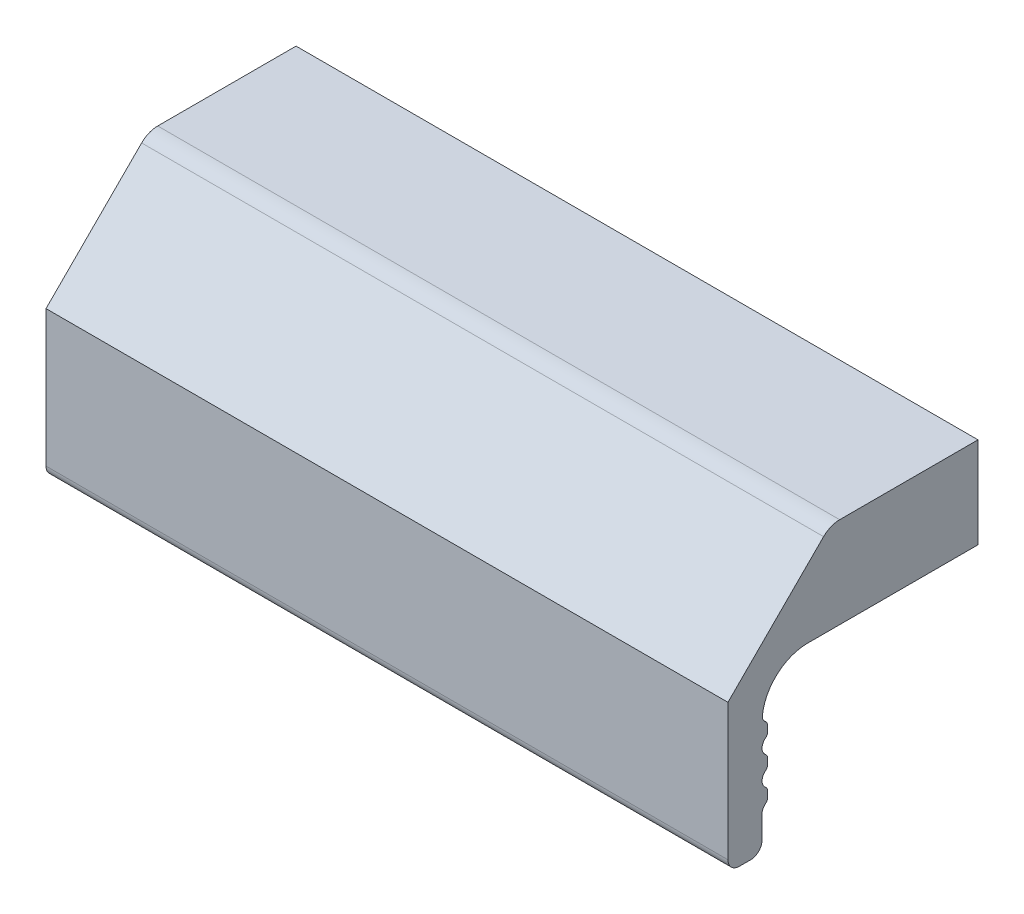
ISO-10303-21;
HEADER;
FILE_DESCRIPTION(('STEP AP214'),'2;1');
FILE_NAME('part.step','',(''),(''),'','','');
FILE_SCHEMA(('AUTOMOTIVE_DESIGN { 1 0 10303 214 1 1 1 1 }'));
ENDSEC;
DATA;
#1=APPLICATION_CONTEXT('core data for automotive mechanical design processes');
#2=APPLICATION_PROTOCOL_DEFINITION('international standard','automotive_design',2000,#1);
#3=PRODUCT_CONTEXT('',#1,'mechanical');
#4=PRODUCT('Part','Part','',(#3));
#5=PRODUCT_RELATED_PRODUCT_CATEGORY('part','',(#4));
#6=PRODUCT_DEFINITION_FORMATION('','',#4);
#7=PRODUCT_DEFINITION_CONTEXT('part definition',#1,'design');
#8=PRODUCT_DEFINITION('design','',#6,#7);
#9=PRODUCT_DEFINITION_SHAPE('','',#8);
#10=(LENGTH_UNIT() NAMED_UNIT(*) SI_UNIT(.MILLI.,.METRE.));
#11=(NAMED_UNIT(*) PLANE_ANGLE_UNIT() SI_UNIT($,.RADIAN.));
#12=(NAMED_UNIT(*) SI_UNIT($,.STERADIAN.) SOLID_ANGLE_UNIT());
#13=UNCERTAINTY_MEASURE_WITH_UNIT(LENGTH_MEASURE(1.E-05),#10,'distance_accuracy_value','');
#14=(GEOMETRIC_REPRESENTATION_CONTEXT(3) GLOBAL_UNCERTAINTY_ASSIGNED_CONTEXT((#13)) GLOBAL_UNIT_ASSIGNED_CONTEXT((#10,
#11,#12)) REPRESENTATION_CONTEXT('',''));
#15=CARTESIAN_POINT('',(0.,0.,0.));
#16=DIRECTION('',(0.,0.,1.));
#17=DIRECTION('',(1.,0.,0.));
#18=AXIS2_PLACEMENT_3D('',#15,#16,#17);
#19=CARTESIAN_POINT('',(52.5,-17.,22.));
#20=DIRECTION('',(0.,0.,1.));
#21=DIRECTION('',(1.,0.,0.));
#22=AXIS2_PLACEMENT_3D('',#19,#20,#21);
#23=PLANE('',#22);
#24=DIRECTION('',(-1.,0.,0.));
#25=VECTOR('',#24,1.);
#26=CARTESIAN_POINT('',(52.5,-17.,22.));
#27=LINE('',#26,#25);
#28=CARTESIAN_POINT('',(52.5,-17.,22.));
#29=VERTEX_POINT('',#28);
#30=CARTESIAN_POINT('',(-7.5,-17.,22.));
#31=VERTEX_POINT('',#30);
#32=EDGE_CURVE('E9',#29,#31,#27,.T.);
#33=ORIENTED_EDGE('',*,*,#32,.F.);
#34=DIRECTION('',(0.,1.,0.));
#35=VECTOR('',#34,1.);
#36=CARTESIAN_POINT('',(52.5,-17.,22.));
#37=LINE('',#36,#35);
#38=CARTESIAN_POINT('',(52.5,-5.,22.));
#39=VERTEX_POINT('',#38);
#40=EDGE_CURVE('E181',#29,#39,#37,.T.);
#41=ORIENTED_EDGE('',*,*,#40,.T.);
#42=DIRECTION('',(-1.,0.,0.));
#43=VECTOR('',#42,1.);
#44=CARTESIAN_POINT('',(52.5,-5.,22.));
#45=LINE('',#44,#43);
#46=CARTESIAN_POINT('',(-7.5,-5.,22.));
#47=VERTEX_POINT('',#46);
#48=EDGE_CURVE('E177',#39,#47,#45,.T.);
#49=ORIENTED_EDGE('',*,*,#48,.T.);
#50=DIRECTION('',(0.,1.,0.));
#51=VECTOR('',#50,1.);
#52=CARTESIAN_POINT('',(-7.5,-17.,22.));
#53=LINE('',#52,#51);
#54=EDGE_CURVE('E179',#31,#47,#53,.T.);
#55=ORIENTED_EDGE('',*,*,#54,.F.);
#56=EDGE_LOOP('',(#33,#41,#49,#55));
#57=FACE_BOUND('',#56,.T.);
#58=ADVANCED_FACE('F14',(#57),#23,.T.);
#59=CARTESIAN_POINT('',(52.5,-17.,21.));
#60=DIRECTION('',(-1.,0.,0.));
#61=DIRECTION('',(0.,0.,1.));
#62=AXIS2_PLACEMENT_3D('',#59,#60,#61);
#63=CYLINDRICAL_SURFACE('',#62,1.);
#64=DIRECTION('',(-1.,0.,0.));
#65=VECTOR('',#64,1.);
#66=CARTESIAN_POINT('',(52.5,-18.,21.));
#67=LINE('',#66,#65);
#68=CARTESIAN_POINT('',(52.5,-18.,21.));
#69=VERTEX_POINT('',#68);
#70=CARTESIAN_POINT('',(-7.5,-18.,21.));
#71=VERTEX_POINT('',#70);
#72=EDGE_CURVE('E22',#69,#71,#67,.T.);
#73=ORIENTED_EDGE('',*,*,#72,.F.);
#74=CARTESIAN_POINT('',(52.5,-17.,21.));
#75=DIRECTION('',(1.,0.,0.));
#76=DIRECTION('',(0.,0.,-1.));
#77=AXIS2_PLACEMENT_3D('',#74,#75,#76);
#78=CIRCLE('',#77,1.);
#79=EDGE_CURVE('E187',#29,#69,#78,.T.);
#80=ORIENTED_EDGE('',*,*,#79,.F.);
#81=ORIENTED_EDGE('',*,*,#32,.T.);
#82=CARTESIAN_POINT('',(-7.5,-17.,21.));
#83=DIRECTION('',(1.,0.,0.));
#84=DIRECTION('',(0.,0.,-1.));
#85=AXIS2_PLACEMENT_3D('',#82,#83,#84);
#86=CIRCLE('',#85,1.);
#87=EDGE_CURVE('E196',#31,#71,#86,.T.);
#88=ORIENTED_EDGE('',*,*,#87,.T.);
#89=EDGE_LOOP('',(#73,#80,#81,#88));
#90=FACE_BOUND('',#89,.T.);
#91=ADVANCED_FACE('F16',(#90),#63,.T.);
#92=CARTESIAN_POINT('',(52.5,-18.,20.));
#93=DIRECTION('',(0.,-1.,0.));
#94=DIRECTION('',(-1.,0.,0.));
#95=AXIS2_PLACEMENT_3D('',#92,#93,#94);
#96=PLANE('',#95);
#97=DIRECTION('',(-1.,0.,0.));
#98=VECTOR('',#97,1.);
#99=CARTESIAN_POINT('',(52.5,-18.,20.));
#100=LINE('',#99,#98);
#101=CARTESIAN_POINT('',(52.5,-18.,20.));
#102=VERTEX_POINT('',#101);
#103=CARTESIAN_POINT('',(-7.5,-18.,20.));
#104=VERTEX_POINT('',#103);
#105=EDGE_CURVE('E379',#102,#104,#100,.T.);
#106=ORIENTED_EDGE('',*,*,#105,.F.);
#107=DIRECTION('',(0.,0.,1.));
#108=VECTOR('',#107,1.);
#109=CARTESIAN_POINT('',(52.5,-18.,20.));
#110=LINE('',#109,#108);
#111=EDGE_CURVE('E334',#102,#69,#110,.T.);
#112=ORIENTED_EDGE('',*,*,#111,.T.);
#113=ORIENTED_EDGE('',*,*,#72,.T.);
#114=DIRECTION('',(0.,0.,1.));
#115=VECTOR('',#114,1.);
#116=CARTESIAN_POINT('',(-7.5,-18.,20.));
#117=LINE('',#116,#115);
#118=EDGE_CURVE('E265',#104,#71,#117,.T.);
#119=ORIENTED_EDGE('',*,*,#118,.F.);
#120=EDGE_LOOP('',(#106,#112,#113,#119));
#121=FACE_BOUND('',#120,.T.);
#122=ADVANCED_FACE('F382',(#121),#96,.T.);
#123=CARTESIAN_POINT('',(52.5,-17.,20.));
#124=DIRECTION('',(-1.,0.,0.));
#125=DIRECTION('',(0.,0.,1.));
#126=AXIS2_PLACEMENT_3D('',#123,#124,#125);
#127=CYLINDRICAL_SURFACE('',#126,1.);
#128=DIRECTION('',(-1.,0.,0.));
#129=VECTOR('',#128,1.);
#130=CARTESIAN_POINT('',(52.5,-17.,19.));
#131=LINE('',#130,#129);
#132=CARTESIAN_POINT('',(52.5,-17.,19.));
#133=VERTEX_POINT('',#132);
#134=CARTESIAN_POINT('',(-7.5,-17.,19.));
#135=VERTEX_POINT('',#134);
#136=EDGE_CURVE('E377',#133,#135,#131,.T.);
#137=ORIENTED_EDGE('',*,*,#136,.F.);
#138=CARTESIAN_POINT('',(52.5,-17.,20.));
#139=DIRECTION('',(1.,0.,0.));
#140=DIRECTION('',(0.,0.,-1.));
#141=AXIS2_PLACEMENT_3D('',#138,#139,#140);
#142=CIRCLE('',#141,1.);
#143=EDGE_CURVE('E331',#102,#133,#142,.T.);
#144=ORIENTED_EDGE('',*,*,#143,.F.);
#145=ORIENTED_EDGE('',*,*,#105,.T.);
#146=CARTESIAN_POINT('',(-7.5,-17.,20.));
#147=DIRECTION('',(1.,0.,0.));
#148=DIRECTION('',(0.,0.,-1.));
#149=AXIS2_PLACEMENT_3D('',#146,#147,#148);
#150=CIRCLE('',#149,1.);
#151=EDGE_CURVE('E262',#104,#135,#150,.T.);
#152=ORIENTED_EDGE('',*,*,#151,.T.);
#153=EDGE_LOOP('',(#137,#144,#145,#152));
#154=FACE_BOUND('',#153,.T.);
#155=ADVANCED_FACE('F468',(#154),#127,.T.);
#156=CARTESIAN_POINT('',(52.5,-17.,19.));
#157=DIRECTION('',(0.,-1.80411241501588E-13,1.));
#158=DIRECTION('',(0.,-1.,-1.80411241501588E-13));
#159=AXIS2_PLACEMENT_3D('',#156,#157,#158);
#160=PLANE('',#159);
#161=DIRECTION('',(-1.,0.,0.));
#162=VECTOR('',#161,1.);
#163=CARTESIAN_POINT('',(52.5,-15.,19.));
#164=LINE('',#163,#162);
#165=CARTESIAN_POINT('',(52.5,-15.,19.));
#166=VERTEX_POINT('',#165);
#167=CARTESIAN_POINT('',(-7.5,-15.,19.));
#168=VERTEX_POINT('',#167);
#169=EDGE_CURVE('E375',#166,#168,#164,.T.);
#170=ORIENTED_EDGE('',*,*,#169,.F.);
#171=DIRECTION('',(0.,1.,1.80411241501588E-13));
#172=VECTOR('',#171,1.);
#173=CARTESIAN_POINT('',(52.5,-17.,19.));
#174=LINE('',#173,#172);
#175=EDGE_CURVE('E328',#133,#166,#174,.T.);
#176=ORIENTED_EDGE('',*,*,#175,.F.);
#177=ORIENTED_EDGE('',*,*,#136,.T.);
#178=DIRECTION('',(0.,1.,1.80411241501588E-13));
#179=VECTOR('',#178,1.);
#180=CARTESIAN_POINT('',(-7.5,-17.,19.));
#181=LINE('',#180,#179);
#182=EDGE_CURVE('E259',#135,#168,#181,.T.);
#183=ORIENTED_EDGE('',*,*,#182,.T.);
#184=EDGE_LOOP('',(#170,#176,#177,#183));
#185=FACE_BOUND('',#184,.T.);
#186=ADVANCED_FACE('F464',(#185),#160,.F.);
#187=CARTESIAN_POINT('',(52.5,-15.,18.2));
#188=DIRECTION('',(-1.,0.,0.));
#189=DIRECTION('',(0.,0.,1.));
#190=AXIS2_PLACEMENT_3D('',#187,#188,#189);
#191=CYLINDRICAL_SURFACE('',#190,0.800000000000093);
#192=DIRECTION('',(-1.,0.,0.));
#193=VECTOR('',#192,1.);
#194=CARTESIAN_POINT('',(52.5,-14.3694184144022,18.6923076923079));
#195=LINE('',#194,#193);
#196=CARTESIAN_POINT('',(52.5,-14.3694184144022,18.6923076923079));
#197=VERTEX_POINT('',#196);
#198=CARTESIAN_POINT('',(-7.5,-14.3694184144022,18.6923076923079));
#199=VERTEX_POINT('',#198);
#200=EDGE_CURVE('E373',#197,#199,#195,.T.);
#201=ORIENTED_EDGE('',*,*,#200,.F.);
#202=CARTESIAN_POINT('',(52.5,-15.,18.2));
#203=DIRECTION('',(1.,0.,0.));
#204=DIRECTION('',(0.,0.,-1.));
#205=AXIS2_PLACEMENT_3D('',#202,#203,#204);
#206=CIRCLE('',#205,0.800000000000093);
#207=EDGE_CURVE('E325',#197,#166,#206,.T.);
#208=ORIENTED_EDGE('',*,*,#207,.T.);
#209=ORIENTED_EDGE('',*,*,#169,.T.);
#210=CARTESIAN_POINT('',(-7.5,-15.,18.2));
#211=DIRECTION('',(1.,0.,0.));
#212=DIRECTION('',(0.,0.,-1.));
#213=AXIS2_PLACEMENT_3D('',#210,#211,#212);
#214=CIRCLE('',#213,0.800000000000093);
#215=EDGE_CURVE('E256',#199,#168,#214,.T.);
#216=ORIENTED_EDGE('',*,*,#215,.F.);
#217=EDGE_LOOP('',(#201,#208,#209,#216));
#218=FACE_BOUND('',#217,.T.);
#219=ADVANCED_FACE('F462',(#218),#191,.F.);
#220=CARTESIAN_POINT('',(52.5,-13.9753049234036,19.));
#221=DIRECTION('',(-1.,0.,0.));
#222=DIRECTION('',(0.,0.,1.));
#223=AXIS2_PLACEMENT_3D('',#220,#221,#222);
#224=CYLINDRICAL_SURFACE('',#223,0.5);
#225=DIRECTION('',(-1.,0.,0.));
#226=VECTOR('',#225,1.);
#227=CARTESIAN_POINT('',(52.5,-13.9753049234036,18.5));
#228=LINE('',#227,#226);
#229=CARTESIAN_POINT('',(52.5,-13.9753049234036,18.5));
#230=VERTEX_POINT('',#229);
#231=CARTESIAN_POINT('',(-7.5,-13.9753049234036,18.5));
#232=VERTEX_POINT('',#231);
#233=EDGE_CURVE('E371',#230,#232,#228,.T.);
#234=ORIENTED_EDGE('',*,*,#233,.F.);
#235=CARTESIAN_POINT('',(52.5,-13.9753049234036,19.));
#236=DIRECTION('',(1.,0.,0.));
#237=DIRECTION('',(0.,0.,-1.));
#238=AXIS2_PLACEMENT_3D('',#235,#236,#237);
#239=CIRCLE('',#238,0.5);
#240=EDGE_CURVE('E322',#197,#230,#239,.T.);
#241=ORIENTED_EDGE('',*,*,#240,.F.);
#242=ORIENTED_EDGE('',*,*,#200,.T.);
#243=CARTESIAN_POINT('',(-7.5,-13.9753049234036,19.));
#244=DIRECTION('',(1.,0.,0.));
#245=DIRECTION('',(0.,0.,-1.));
#246=AXIS2_PLACEMENT_3D('',#243,#244,#245);
#247=CIRCLE('',#246,0.5);
#248=EDGE_CURVE('E253',#199,#232,#247,.T.);
#249=ORIENTED_EDGE('',*,*,#248,.T.);
#250=EDGE_LOOP('',(#234,#241,#242,#249));
#251=FACE_BOUND('',#250,.T.);
#252=ADVANCED_FACE('F458',(#251),#224,.T.);
#253=CARTESIAN_POINT('',(52.5,-13.9753049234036,18.5));
#254=DIRECTION('',(0.,0.,1.));
#255=DIRECTION('',(1.,0.,0.));
#256=AXIS2_PLACEMENT_3D('',#253,#254,#255);
#257=PLANE('',#256);
#258=DIRECTION('',(-1.,0.,0.));
#259=VECTOR('',#258,1.);
#260=CARTESIAN_POINT('',(52.5,-13.5246950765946,18.5));
#261=LINE('',#260,#259);
#262=CARTESIAN_POINT('',(52.5,-13.5246950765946,18.5));
#263=VERTEX_POINT('',#262);
#264=CARTESIAN_POINT('',(-7.5,-13.5246950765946,18.5));
#265=VERTEX_POINT('',#264);
#266=EDGE_CURVE('E369',#263,#265,#261,.T.);
#267=ORIENTED_EDGE('',*,*,#266,.F.);
#268=DIRECTION('',(0.,1.,0.));
#269=VECTOR('',#268,1.);
#270=CARTESIAN_POINT('',(52.5,-13.9753049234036,18.5));
#271=LINE('',#270,#269);
#272=EDGE_CURVE('E319',#230,#263,#271,.T.);
#273=ORIENTED_EDGE('',*,*,#272,.F.);
#274=ORIENTED_EDGE('',*,*,#233,.T.);
#275=DIRECTION('',(0.,1.,0.));
#276=VECTOR('',#275,1.);
#277=CARTESIAN_POINT('',(-7.5,-13.9753049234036,18.5));
#278=LINE('',#277,#276);
#279=EDGE_CURVE('E250',#232,#265,#278,.T.);
#280=ORIENTED_EDGE('',*,*,#279,.T.);
#281=EDGE_LOOP('',(#267,#273,#274,#280));
#282=FACE_BOUND('',#281,.T.);
#283=ADVANCED_FACE('F454',(#282),#257,.F.);
#284=CARTESIAN_POINT('',(52.5,-13.5246950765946,19.));
#285=DIRECTION('',(-1.,0.,0.));
#286=DIRECTION('',(0.,0.,1.));
#287=AXIS2_PLACEMENT_3D('',#284,#285,#286);
#288=CYLINDRICAL_SURFACE('',#287,0.499999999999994);
#289=DIRECTION('',(-1.,0.,0.));
#290=VECTOR('',#289,1.);
#291=CARTESIAN_POINT('',(52.5,-13.1305815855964,18.6923076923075));
#292=LINE('',#291,#290);
#293=CARTESIAN_POINT('',(52.5,-13.1305815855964,18.6923076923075));
#294=VERTEX_POINT('',#293);
#295=CARTESIAN_POINT('',(-7.5,-13.1305815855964,18.6923076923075));
#296=VERTEX_POINT('',#295);
#297=EDGE_CURVE('E367',#294,#296,#292,.T.);
#298=ORIENTED_EDGE('',*,*,#297,.F.);
#299=CARTESIAN_POINT('',(52.5,-13.5246950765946,19.));
#300=DIRECTION('',(1.,0.,0.));
#301=DIRECTION('',(0.,0.,-1.));
#302=AXIS2_PLACEMENT_3D('',#299,#300,#301);
#303=CIRCLE('',#302,0.499999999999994);
#304=EDGE_CURVE('E316',#263,#294,#303,.T.);
#305=ORIENTED_EDGE('',*,*,#304,.F.);
#306=ORIENTED_EDGE('',*,*,#266,.T.);
#307=CARTESIAN_POINT('',(-7.5,-13.5246950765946,19.));
#308=DIRECTION('',(1.,0.,0.));
#309=DIRECTION('',(0.,0.,-1.));
#310=AXIS2_PLACEMENT_3D('',#307,#308,#309);
#311=CIRCLE('',#310,0.499999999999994);
#312=EDGE_CURVE('E247',#265,#296,#311,.T.);
#313=ORIENTED_EDGE('',*,*,#312,.T.);
#314=EDGE_LOOP('',(#298,#305,#306,#313));
#315=FACE_BOUND('',#314,.T.);
#316=ADVANCED_FACE('F450',(#315),#288,.T.);
#317=CARTESIAN_POINT('',(52.5,-12.5,18.2));
#318=DIRECTION('',(-1.,0.,0.));
#319=DIRECTION('',(0.,0.,1.));
#320=AXIS2_PLACEMENT_3D('',#317,#318,#319);
#321=CYLINDRICAL_SURFACE('',#320,0.799999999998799);
#322=DIRECTION('',(-1.,0.,0.));
#323=VECTOR('',#322,1.);
#324=CARTESIAN_POINT('',(52.5,-11.8694184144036,18.6923076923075));
#325=LINE('',#324,#323);
#326=CARTESIAN_POINT('',(52.5,-11.8694184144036,18.6923076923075));
#327=VERTEX_POINT('',#326);
#328=CARTESIAN_POINT('',(-7.5,-11.8694184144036,18.6923076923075));
#329=VERTEX_POINT('',#328);
#330=EDGE_CURVE('E365',#327,#329,#325,.T.);
#331=ORIENTED_EDGE('',*,*,#330,.F.);
#332=CARTESIAN_POINT('',(52.5,-12.5,18.2));
#333=DIRECTION('',(1.,0.,0.));
#334=DIRECTION('',(0.,0.,-1.));
#335=AXIS2_PLACEMENT_3D('',#332,#333,#334);
#336=CIRCLE('',#335,0.799999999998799);
#337=EDGE_CURVE('E313',#327,#294,#336,.T.);
#338=ORIENTED_EDGE('',*,*,#337,.T.);
#339=ORIENTED_EDGE('',*,*,#297,.T.);
#340=CARTESIAN_POINT('',(-7.5,-12.5,18.2));
#341=DIRECTION('',(1.,0.,0.));
#342=DIRECTION('',(0.,0.,-1.));
#343=AXIS2_PLACEMENT_3D('',#340,#341,#342);
#344=CIRCLE('',#343,0.799999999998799);
#345=EDGE_CURVE('E244',#329,#296,#344,.T.);
#346=ORIENTED_EDGE('',*,*,#345,.F.);
#347=EDGE_LOOP('',(#331,#338,#339,#346));
#348=FACE_BOUND('',#347,.T.);
#349=ADVANCED_FACE('F446',(#348),#321,.F.);
#350=CARTESIAN_POINT('',(52.5,-11.4753049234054,19.));
#351=DIRECTION('',(-1.,0.,0.));
#352=DIRECTION('',(0.,0.,1.));
#353=AXIS2_PLACEMENT_3D('',#350,#351,#352);
#354=CYLINDRICAL_SURFACE('',#353,0.5);
#355=DIRECTION('',(-1.,0.,0.));
#356=VECTOR('',#355,1.);
#357=CARTESIAN_POINT('',(52.5,-11.4753049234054,18.5));
#358=LINE('',#357,#356);
#359=CARTESIAN_POINT('',(52.5,-11.4753049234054,18.5));
#360=VERTEX_POINT('',#359);
#361=CARTESIAN_POINT('',(-7.5,-11.4753049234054,18.5));
#362=VERTEX_POINT('',#361);
#363=EDGE_CURVE('E363',#360,#362,#358,.T.);
#364=ORIENTED_EDGE('',*,*,#363,.F.);
#365=CARTESIAN_POINT('',(52.5,-11.4753049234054,19.));
#366=DIRECTION('',(1.,0.,0.));
#367=DIRECTION('',(0.,0.,-1.));
#368=AXIS2_PLACEMENT_3D('',#365,#366,#367);
#369=CIRCLE('',#368,0.5);
#370=EDGE_CURVE('E310',#327,#360,#369,.T.);
#371=ORIENTED_EDGE('',*,*,#370,.F.);
#372=ORIENTED_EDGE('',*,*,#330,.T.);
#373=CARTESIAN_POINT('',(-7.5,-11.4753049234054,19.));
#374=DIRECTION('',(1.,0.,0.));
#375=DIRECTION('',(0.,0.,-1.));
#376=AXIS2_PLACEMENT_3D('',#373,#374,#375);
#377=CIRCLE('',#376,0.5);
#378=EDGE_CURVE('E241',#329,#362,#377,.T.);
#379=ORIENTED_EDGE('',*,*,#378,.T.);
#380=EDGE_LOOP('',(#364,#371,#372,#379));
#381=FACE_BOUND('',#380,.T.);
#382=ADVANCED_FACE('F442',(#381),#354,.T.);
#383=CARTESIAN_POINT('',(52.5,-11.4753049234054,18.5));
#384=DIRECTION('',(0.,0.,1.));
#385=DIRECTION('',(1.,0.,0.));
#386=AXIS2_PLACEMENT_3D('',#383,#384,#385);
#387=PLANE('',#386);
#388=DIRECTION('',(-1.,0.,0.));
#389=VECTOR('',#388,1.);
#390=CARTESIAN_POINT('',(52.5,-11.0246950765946,18.5));
#391=LINE('',#390,#389);
#392=CARTESIAN_POINT('',(52.5,-11.0246950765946,18.5));
#393=VERTEX_POINT('',#392);
#394=CARTESIAN_POINT('',(-7.5,-11.0246950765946,18.5));
#395=VERTEX_POINT('',#394);
#396=EDGE_CURVE('E361',#393,#395,#391,.T.);
#397=ORIENTED_EDGE('',*,*,#396,.F.);
#398=DIRECTION('',(0.,1.,0.));
#399=VECTOR('',#398,1.);
#400=CARTESIAN_POINT('',(52.5,-11.4753049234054,18.5));
#401=LINE('',#400,#399);
#402=EDGE_CURVE('E307',#360,#393,#401,.T.);
#403=ORIENTED_EDGE('',*,*,#402,.F.);
#404=ORIENTED_EDGE('',*,*,#363,.T.);
#405=DIRECTION('',(0.,1.,0.));
#406=VECTOR('',#405,1.);
#407=CARTESIAN_POINT('',(-7.5,-11.4753049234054,18.5));
#408=LINE('',#407,#406);
#409=EDGE_CURVE('E238',#362,#395,#408,.T.);
#410=ORIENTED_EDGE('',*,*,#409,.T.);
#411=EDGE_LOOP('',(#397,#403,#404,#410));
#412=FACE_BOUND('',#411,.T.);
#413=ADVANCED_FACE('F438',(#412),#387,.F.);
#414=CARTESIAN_POINT('',(52.5,-11.0246950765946,19.));
#415=DIRECTION('',(-1.,0.,0.));
#416=DIRECTION('',(0.,0.,1.));
#417=AXIS2_PLACEMENT_3D('',#414,#415,#416);
#418=CYLINDRICAL_SURFACE('',#417,0.499999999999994);
#419=DIRECTION('',(-1.,0.,0.));
#420=VECTOR('',#419,1.);
#421=CARTESIAN_POINT('',(52.5,-10.630581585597,18.692307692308));
#422=LINE('',#421,#420);
#423=CARTESIAN_POINT('',(52.5,-10.630581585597,18.692307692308));
#424=VERTEX_POINT('',#423);
#425=CARTESIAN_POINT('',(-7.5,-10.630581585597,18.692307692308));
#426=VERTEX_POINT('',#425);
#427=EDGE_CURVE('E359',#424,#426,#422,.T.);
#428=ORIENTED_EDGE('',*,*,#427,.F.);
#429=CARTESIAN_POINT('',(52.5,-11.0246950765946,19.));
#430=DIRECTION('',(1.,0.,0.));
#431=DIRECTION('',(0.,0.,-1.));
#432=AXIS2_PLACEMENT_3D('',#429,#430,#431);
#433=CIRCLE('',#432,0.499999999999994);
#434=EDGE_CURVE('E304',#393,#424,#433,.T.);
#435=ORIENTED_EDGE('',*,*,#434,.F.);
#436=ORIENTED_EDGE('',*,*,#396,.T.);
#437=CARTESIAN_POINT('',(-7.5,-11.0246950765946,19.));
#438=DIRECTION('',(1.,0.,0.));
#439=DIRECTION('',(0.,0.,-1.));
#440=AXIS2_PLACEMENT_3D('',#437,#438,#439);
#441=CIRCLE('',#440,0.499999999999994);
#442=EDGE_CURVE('E235',#395,#426,#441,.T.);
#443=ORIENTED_EDGE('',*,*,#442,.T.);
#444=EDGE_LOOP('',(#428,#435,#436,#443));
#445=FACE_BOUND('',#444,.T.);
#446=ADVANCED_FACE('F434',(#445),#418,.T.);
#447=CARTESIAN_POINT('',(52.5,-10.,18.2));
#448=DIRECTION('',(-1.,0.,0.));
#449=DIRECTION('',(0.,0.,1.));
#450=AXIS2_PLACEMENT_3D('',#447,#448,#449);
#451=CYLINDRICAL_SURFACE('',#450,0.799999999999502);
#452=DIRECTION('',(-1.,0.,0.));
#453=VECTOR('',#452,1.);
#454=CARTESIAN_POINT('',(52.5,-9.36941841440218,18.6923076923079));
#455=LINE('',#454,#453);
#456=CARTESIAN_POINT('',(52.5,-9.36941841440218,18.6923076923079));
#457=VERTEX_POINT('',#456);
#458=CARTESIAN_POINT('',(-7.5,-9.36941841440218,18.6923076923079));
#459=VERTEX_POINT('',#458);
#460=EDGE_CURVE('E357',#457,#459,#455,.T.);
#461=ORIENTED_EDGE('',*,*,#460,.F.);
#462=CARTESIAN_POINT('',(52.5,-10.,18.2));
#463=DIRECTION('',(1.,0.,0.));
#464=DIRECTION('',(0.,0.,-1.));
#465=AXIS2_PLACEMENT_3D('',#462,#463,#464);
#466=CIRCLE('',#465,0.799999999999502);
#467=EDGE_CURVE('E301',#457,#424,#466,.T.);
#468=ORIENTED_EDGE('',*,*,#467,.T.);
#469=ORIENTED_EDGE('',*,*,#427,.T.);
#470=CARTESIAN_POINT('',(-7.5,-10.,18.2));
#471=DIRECTION('',(1.,0.,0.));
#472=DIRECTION('',(0.,0.,-1.));
#473=AXIS2_PLACEMENT_3D('',#470,#471,#472);
#474=CIRCLE('',#473,0.799999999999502);
#475=EDGE_CURVE('E232',#459,#426,#474,.T.);
#476=ORIENTED_EDGE('',*,*,#475,.F.);
#477=EDGE_LOOP('',(#461,#468,#469,#476));
#478=FACE_BOUND('',#477,.T.);
#479=ADVANCED_FACE('F430',(#478),#451,.F.);
#480=CARTESIAN_POINT('',(52.5,-8.97530492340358,19.));
#481=DIRECTION('',(-1.,0.,0.));
#482=DIRECTION('',(0.,0.,1.));
#483=AXIS2_PLACEMENT_3D('',#480,#481,#482);
#484=CYLINDRICAL_SURFACE('',#483,0.5);
#485=DIRECTION('',(-1.,0.,0.));
#486=VECTOR('',#485,1.);
#487=CARTESIAN_POINT('',(52.5,-8.97530492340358,18.5));
#488=LINE('',#487,#486);
#489=CARTESIAN_POINT('',(52.5,-8.97530492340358,18.5));
#490=VERTEX_POINT('',#489);
#491=CARTESIAN_POINT('',(-7.5,-8.97530492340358,18.5));
#492=VERTEX_POINT('',#491);
#493=EDGE_CURVE('E355',#490,#492,#488,.T.);
#494=ORIENTED_EDGE('',*,*,#493,.F.);
#495=CARTESIAN_POINT('',(52.5,-8.97530492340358,19.));
#496=DIRECTION('',(1.,0.,0.));
#497=DIRECTION('',(0.,0.,-1.));
#498=AXIS2_PLACEMENT_3D('',#495,#496,#497);
#499=CIRCLE('',#498,0.5);
#500=EDGE_CURVE('E298',#457,#490,#499,.T.);
#501=ORIENTED_EDGE('',*,*,#500,.F.);
#502=ORIENTED_EDGE('',*,*,#460,.T.);
#503=CARTESIAN_POINT('',(-7.5,-8.97530492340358,19.));
#504=DIRECTION('',(1.,0.,0.));
#505=DIRECTION('',(0.,0.,-1.));
#506=AXIS2_PLACEMENT_3D('',#503,#504,#505);
#507=CIRCLE('',#506,0.5);
#508=EDGE_CURVE('E229',#459,#492,#507,.T.);
#509=ORIENTED_EDGE('',*,*,#508,.T.);
#510=EDGE_LOOP('',(#494,#501,#502,#509));
#511=FACE_BOUND('',#510,.T.);
#512=ADVANCED_FACE('F426',(#511),#484,.T.);
#513=CARTESIAN_POINT('',(52.5,-8.97530492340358,18.5));
#514=DIRECTION('',(0.,0.,1.));
#515=DIRECTION('',(1.,0.,0.));
#516=AXIS2_PLACEMENT_3D('',#513,#514,#515);
#517=PLANE('',#516);
#518=DIRECTION('',(-1.,0.,0.));
#519=VECTOR('',#518,1.);
#520=CARTESIAN_POINT('',(52.5,-8.52469507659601,18.5));
#521=LINE('',#520,#519);
#522=CARTESIAN_POINT('',(52.5,-8.52469507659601,18.5));
#523=VERTEX_POINT('',#522);
#524=CARTESIAN_POINT('',(-7.5,-8.52469507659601,18.5));
#525=VERTEX_POINT('',#524);
#526=EDGE_CURVE('E353',#523,#525,#521,.T.);
#527=ORIENTED_EDGE('',*,*,#526,.F.);
#528=DIRECTION('',(0.,1.,0.));
#529=VECTOR('',#528,1.);
#530=CARTESIAN_POINT('',(52.5,-8.97530492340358,18.5));
#531=LINE('',#530,#529);
#532=EDGE_CURVE('E295',#490,#523,#531,.T.);
#533=ORIENTED_EDGE('',*,*,#532,.F.);
#534=ORIENTED_EDGE('',*,*,#493,.T.);
#535=DIRECTION('',(0.,1.,0.));
#536=VECTOR('',#535,1.);
#537=CARTESIAN_POINT('',(-7.5,-8.97530492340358,18.5));
#538=LINE('',#537,#536);
#539=EDGE_CURVE('E226',#492,#525,#538,.T.);
#540=ORIENTED_EDGE('',*,*,#539,.T.);
#541=EDGE_LOOP('',(#527,#533,#534,#540));
#542=FACE_BOUND('',#541,.T.);
#543=ADVANCED_FACE('F422',(#542),#517,.F.);
#544=CARTESIAN_POINT('',(52.5,-8.52469507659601,19.));
#545=DIRECTION('',(-1.,0.,0.));
#546=DIRECTION('',(0.,0.,1.));
#547=AXIS2_PLACEMENT_3D('',#544,#545,#546);
#548=CYLINDRICAL_SURFACE('',#547,0.5);
#549=DIRECTION('',(-1.,0.,0.));
#550=VECTOR('',#549,1.);
#551=CARTESIAN_POINT('',(52.5,-8.1305815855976,18.6923076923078));
#552=LINE('',#551,#550);
#553=CARTESIAN_POINT('',(52.5,-8.1305815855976,18.6923076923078));
#554=VERTEX_POINT('',#553);
#555=CARTESIAN_POINT('',(-7.5,-8.1305815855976,18.6923076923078));
#556=VERTEX_POINT('',#555);
#557=EDGE_CURVE('E351',#554,#556,#552,.T.);
#558=ORIENTED_EDGE('',*,*,#557,.F.);
#559=CARTESIAN_POINT('',(52.5,-8.52469507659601,19.));
#560=DIRECTION('',(1.,0.,0.));
#561=DIRECTION('',(0.,0.,-1.));
#562=AXIS2_PLACEMENT_3D('',#559,#560,#561);
#563=CIRCLE('',#562,0.5);
#564=EDGE_CURVE('E292',#523,#554,#563,.T.);
#565=ORIENTED_EDGE('',*,*,#564,.F.);
#566=ORIENTED_EDGE('',*,*,#526,.T.);
#567=CARTESIAN_POINT('',(-7.5,-8.52469507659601,19.));
#568=DIRECTION('',(1.,0.,0.));
#569=DIRECTION('',(0.,0.,-1.));
#570=AXIS2_PLACEMENT_3D('',#567,#568,#569);
#571=CIRCLE('',#570,0.5);
#572=EDGE_CURVE('E223',#525,#556,#571,.T.);
#573=ORIENTED_EDGE('',*,*,#572,.T.);
#574=EDGE_LOOP('',(#558,#565,#566,#573));
#575=FACE_BOUND('',#574,.T.);
#576=ADVANCED_FACE('F418',(#575),#548,.T.);
#577=CARTESIAN_POINT('',(52.5,-7.5,18.2));
#578=DIRECTION('',(-1.,0.,0.));
#579=DIRECTION('',(0.,0.,1.));
#580=AXIS2_PLACEMENT_3D('',#577,#578,#579);
#581=CYLINDRICAL_SURFACE('',#580,0.799999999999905);
#582=DIRECTION('',(-1.,0.,0.));
#583=VECTOR('',#582,1.);
#584=CARTESIAN_POINT('',(52.5,-7.7980536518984,18.9424042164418));
#585=LINE('',#584,#583);
#586=CARTESIAN_POINT('',(52.5,-7.7980536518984,18.9424042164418));
#587=VERTEX_POINT('',#586);
#588=CARTESIAN_POINT('',(-7.5,-7.7980536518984,18.9424042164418));
#589=VERTEX_POINT('',#588);
#590=EDGE_CURVE('E349',#587,#589,#585,.T.);
#591=ORIENTED_EDGE('',*,*,#590,.F.);
#592=CARTESIAN_POINT('',(52.5,-7.5,18.2));
#593=DIRECTION('',(1.,0.,0.));
#594=DIRECTION('',(0.,0.,-1.));
#595=AXIS2_PLACEMENT_3D('',#592,#593,#594);
#596=CIRCLE('',#595,0.799999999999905);
#597=EDGE_CURVE('E289',#587,#554,#596,.T.);
#598=ORIENTED_EDGE('',*,*,#597,.T.);
#599=ORIENTED_EDGE('',*,*,#557,.T.);
#600=CARTESIAN_POINT('',(-7.5,-7.5,18.2));
#601=DIRECTION('',(1.,0.,0.));
#602=DIRECTION('',(0.,0.,-1.));
#603=AXIS2_PLACEMENT_3D('',#600,#601,#602);
#604=CIRCLE('',#603,0.799999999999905);
#605=EDGE_CURVE('E220',#589,#556,#604,.T.);
#606=ORIENTED_EDGE('',*,*,#605,.F.);
#607=EDGE_LOOP('',(#591,#598,#599,#606));
#608=FACE_BOUND('',#607,.T.);
#609=ADVANCED_FACE('F414',(#608),#581,.F.);
#610=CARTESIAN_POINT('',(52.5,-7.61177011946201,18.4784015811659));
#611=DIRECTION('',(-1.,0.,0.));
#612=DIRECTION('',(0.,0.,1.));
#613=AXIS2_PLACEMENT_3D('',#610,#611,#612);
#614=CYLINDRICAL_SURFACE('',#613,0.5);
#615=DIRECTION('',(-1.,0.,0.));
#616=VECTOR('',#615,1.);
#617=CARTESIAN_POINT('',(52.5,-7.55630870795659,18.975316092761));
#618=LINE('',#617,#616);
#619=CARTESIAN_POINT('',(52.5,-7.55630870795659,18.975316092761));
#620=VERTEX_POINT('',#619);
#621=CARTESIAN_POINT('',(-7.5,-7.55630870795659,18.975316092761));
#622=VERTEX_POINT('',#621);
#623=EDGE_CURVE('E347',#620,#622,#618,.T.);
#624=ORIENTED_EDGE('',*,*,#623,.F.);
#625=CARTESIAN_POINT('',(52.5,-7.61177011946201,18.4784015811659));
#626=DIRECTION('',(1.,0.,0.));
#627=DIRECTION('',(0.,0.,-1.));
#628=AXIS2_PLACEMENT_3D('',#625,#626,#627);
#629=CIRCLE('',#628,0.5);
#630=EDGE_CURVE('E286',#620,#587,#629,.T.);
#631=ORIENTED_EDGE('',*,*,#630,.T.);
#632=ORIENTED_EDGE('',*,*,#590,.T.);
#633=CARTESIAN_POINT('',(-7.5,-7.61177011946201,18.4784015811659));
#634=DIRECTION('',(1.,0.,0.));
#635=DIRECTION('',(0.,0.,-1.));
#636=AXIS2_PLACEMENT_3D('',#633,#634,#635);
#637=CIRCLE('',#636,0.5);
#638=EDGE_CURVE('E217',#622,#589,#637,.T.);
#639=ORIENTED_EDGE('',*,*,#638,.F.);
#640=EDGE_LOOP('',(#624,#631,#632,#639));
#641=FACE_BOUND('',#640,.T.);
#642=ADVANCED_FACE('F411',(#641),#614,.F.);
#643=CARTESIAN_POINT('',(52.5,-8.,15.));
#644=DIRECTION('',(-1.,0.,0.));
#645=DIRECTION('',(0.,0.,1.));
#646=AXIS2_PLACEMENT_3D('',#643,#644,#645);
#647=CYLINDRICAL_SURFACE('',#646,4.);
#648=DIRECTION('',(-1.,0.,0.));
#649=VECTOR('',#648,1.);
#650=CARTESIAN_POINT('',(52.5,-4.,15.));
#651=LINE('',#650,#649);
#652=CARTESIAN_POINT('',(52.5,-4.,15.));
#653=VERTEX_POINT('',#652);
#654=CARTESIAN_POINT('',(-7.5,-4.,15.));
#655=VERTEX_POINT('',#654);
#656=EDGE_CURVE('E345',#653,#655,#651,.T.);
#657=ORIENTED_EDGE('',*,*,#656,.F.);
#658=CARTESIAN_POINT('',(52.5,-8.,15.));
#659=DIRECTION('',(1.,0.,0.));
#660=DIRECTION('',(0.,0.,-1.));
#661=AXIS2_PLACEMENT_3D('',#658,#659,#660);
#662=CIRCLE('',#661,4.);
#663=EDGE_CURVE('E283',#653,#620,#662,.T.);
#664=ORIENTED_EDGE('',*,*,#663,.T.);
#665=ORIENTED_EDGE('',*,*,#623,.T.);
#666=CARTESIAN_POINT('',(-7.5,-8.,15.));
#667=DIRECTION('',(1.,0.,0.));
#668=DIRECTION('',(0.,0.,-1.));
#669=AXIS2_PLACEMENT_3D('',#666,#667,#668);
#670=CIRCLE('',#669,4.);
#671=EDGE_CURVE('E214',#655,#622,#670,.T.);
#672=ORIENTED_EDGE('',*,*,#671,.F.);
#673=EDGE_LOOP('',(#657,#664,#665,#672));
#674=FACE_BOUND('',#673,.T.);
#675=ADVANCED_FACE('F406',(#674),#647,.F.);
#676=CARTESIAN_POINT('',(52.5,-4.,0.));
#677=DIRECTION('',(0.,-1.,0.));
#678=DIRECTION('',(-1.,0.,0.));
#679=AXIS2_PLACEMENT_3D('',#676,#677,#678);
#680=PLANE('',#679);
#681=DIRECTION('',(-1.,0.,0.));
#682=VECTOR('',#681,1.);
#683=CARTESIAN_POINT('',(52.5,-4.,0.));
#684=LINE('',#683,#682);
#685=CARTESIAN_POINT('',(52.5,-4.,0.));
#686=VERTEX_POINT('',#685);
#687=CARTESIAN_POINT('',(-7.5,-4.,0.));
#688=VERTEX_POINT('',#687);
#689=EDGE_CURVE('E343',#686,#688,#684,.T.);
#690=ORIENTED_EDGE('',*,*,#689,.F.);
#691=DIRECTION('',(0.,0.,1.));
#692=VECTOR('',#691,1.);
#693=CARTESIAN_POINT('',(52.5,-4.,0.));
#694=LINE('',#693,#692);
#695=EDGE_CURVE('E280',#686,#653,#694,.T.);
#696=ORIENTED_EDGE('',*,*,#695,.T.);
#697=ORIENTED_EDGE('',*,*,#656,.T.);
#698=DIRECTION('',(0.,0.,1.));
#699=VECTOR('',#698,1.);
#700=CARTESIAN_POINT('',(-7.5,-4.,0.));
#701=LINE('',#700,#699);
#702=EDGE_CURVE('E211',#688,#655,#701,.T.);
#703=ORIENTED_EDGE('',*,*,#702,.F.);
#704=EDGE_LOOP('',(#690,#696,#697,#703));
#705=FACE_BOUND('',#704,.T.);
#706=ADVANCED_FACE('F403',(#705),#680,.T.);
#707=CARTESIAN_POINT('',(52.5,4.,0.));
#708=DIRECTION('',(0.,0.,-1.));
#709=DIRECTION('',(-1.,0.,0.));
#710=AXIS2_PLACEMENT_3D('',#707,#708,#709);
#711=PLANE('',#710);
#712=CARTESIAN_POINT('',(0.,0.,0.));
#713=DIRECTION('',(0.,0.,-1.));
#714=DIRECTION('',(-1.,0.,0.));
#715=AXIS2_PLACEMENT_3D('',#712,#713,#714);
#716=CIRCLE('',#715,2.);
#717=CARTESIAN_POINT('',(-2.,0.,0.));
#718=VERTEX_POINT('',#717);
#719=EDGE_CURVE('E736',#718,#718,#716,.T.);
#720=ORIENTED_EDGE('',*,*,#719,.F.);
#721=EDGE_LOOP('',(#720));
#722=FACE_BOUND('',#721,.T.);
#723=CARTESIAN_POINT('',(45.,0.,0.));
#724=DIRECTION('',(0.,0.,-1.));
#725=DIRECTION('',(-1.,0.,0.));
#726=AXIS2_PLACEMENT_3D('',#723,#724,#725);
#727=CIRCLE('',#726,2.);
#728=CARTESIAN_POINT('',(43.,0.,0.));
#729=VERTEX_POINT('',#728);
#730=EDGE_CURVE('E735',#729,#729,#727,.T.);
#731=ORIENTED_EDGE('',*,*,#730,.F.);
#732=EDGE_LOOP('',(#731));
#733=FACE_BOUND('',#732,.T.);
#734=DIRECTION('',(-1.,0.,0.));
#735=VECTOR('',#734,1.);
#736=CARTESIAN_POINT('',(52.5,4.,0.));
#737=LINE('',#736,#735);
#738=CARTESIAN_POINT('',(52.5,4.,0.));
#739=VERTEX_POINT('',#738);
#740=CARTESIAN_POINT('',(-7.5,4.,0.));
#741=VERTEX_POINT('',#740);
#742=EDGE_CURVE('E341',#739,#741,#737,.T.);
#743=ORIENTED_EDGE('',*,*,#742,.F.);
#744=DIRECTION('',(0.,-1.,0.));
#745=VECTOR('',#744,1.);
#746=CARTESIAN_POINT('',(52.5,4.,0.));
#747=LINE('',#746,#745);
#748=EDGE_CURVE('E277',#739,#686,#747,.T.);
#749=ORIENTED_EDGE('',*,*,#748,.T.);
#750=ORIENTED_EDGE('',*,*,#689,.T.);
#751=DIRECTION('',(0.,-1.,0.));
#752=VECTOR('',#751,1.);
#753=CARTESIAN_POINT('',(-7.5,4.,0.));
#754=LINE('',#753,#752);
#755=EDGE_CURVE('E208',#741,#688,#754,.T.);
#756=ORIENTED_EDGE('',*,*,#755,.F.);
#757=EDGE_LOOP('',(#743,#749,#750,#756));
#758=FACE_BOUND('',#757,.T.);
#759=ADVANCED_FACE('F398',(#722,#733,#758),#711,.T.);
#760=CARTESIAN_POINT('',(52.5,4.,12.1715728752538));
#761=DIRECTION('',(0.,1.,0.));
#762=DIRECTION('',(1.,0.,0.));
#763=AXIS2_PLACEMENT_3D('',#760,#761,#762);
#764=PLANE('',#763);
#765=DIRECTION('',(-1.,0.,0.));
#766=VECTOR('',#765,1.);
#767=CARTESIAN_POINT('',(52.5,4.,12.1715728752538));
#768=LINE('',#767,#766);
#769=CARTESIAN_POINT('',(52.5,4.,12.1715728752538));
#770=VERTEX_POINT('',#769);
#771=CARTESIAN_POINT('',(-7.5,4.,12.1715728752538));
#772=VERTEX_POINT('',#771);
#773=EDGE_CURVE('E339',#770,#772,#768,.T.);
#774=ORIENTED_EDGE('',*,*,#773,.F.);
#775=DIRECTION('',(0.,0.,-1.));
#776=VECTOR('',#775,1.);
#777=CARTESIAN_POINT('',(52.5,4.,12.1715728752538));
#778=LINE('',#777,#776);
#779=EDGE_CURVE('E274',#770,#739,#778,.T.);
#780=ORIENTED_EDGE('',*,*,#779,.T.);
#781=ORIENTED_EDGE('',*,*,#742,.T.);
#782=DIRECTION('',(0.,0.,-1.));
#783=VECTOR('',#782,1.);
#784=CARTESIAN_POINT('',(-7.5,4.,12.1715728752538));
#785=LINE('',#784,#783);
#786=EDGE_CURVE('E202',#772,#741,#785,.T.);
#787=ORIENTED_EDGE('',*,*,#786,.F.);
#788=EDGE_LOOP('',(#774,#780,#781,#787));
#789=FACE_BOUND('',#788,.T.);
#790=ADVANCED_FACE('F396',(#789),#764,.T.);
#791=CARTESIAN_POINT('',(52.5,2.,12.1715728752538));
#792=DIRECTION('',(-1.,0.,0.));
#793=DIRECTION('',(0.,0.,1.));
#794=AXIS2_PLACEMENT_3D('',#791,#792,#793);
#795=CYLINDRICAL_SURFACE('',#794,2.);
#796=DIRECTION('',(-1.,0.,0.));
#797=VECTOR('',#796,1.);
#798=CARTESIAN_POINT('',(52.5,3.41421356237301,13.5857864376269));
#799=LINE('',#798,#797);
#800=CARTESIAN_POINT('',(52.5,3.41421356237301,13.5857864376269));
#801=VERTEX_POINT('',#800);
#802=CARTESIAN_POINT('',(-7.5,3.41421356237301,13.5857864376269));
#803=VERTEX_POINT('',#802);
#804=EDGE_CURVE('E186',#801,#803,#799,.T.);
#805=ORIENTED_EDGE('',*,*,#804,.F.);
#806=CARTESIAN_POINT('',(52.5,2.,12.1715728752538));
#807=DIRECTION('',(1.,0.,0.));
#808=DIRECTION('',(0.,0.,-1.));
#809=AXIS2_PLACEMENT_3D('',#806,#807,#808);
#810=CIRCLE('',#809,2.);
#811=EDGE_CURVE('E271',#770,#801,#810,.T.);
#812=ORIENTED_EDGE('',*,*,#811,.F.);
#813=ORIENTED_EDGE('',*,*,#773,.T.);
#814=CARTESIAN_POINT('',(-7.5,2.,12.1715728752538));
#815=DIRECTION('',(1.,0.,0.));
#816=DIRECTION('',(0.,0.,-1.));
#817=AXIS2_PLACEMENT_3D('',#814,#815,#816);
#818=CIRCLE('',#817,2.);
#819=EDGE_CURVE('E200',#772,#803,#818,.T.);
#820=ORIENTED_EDGE('',*,*,#819,.T.);
#821=EDGE_LOOP('',(#805,#812,#813,#820));
#822=FACE_BOUND('',#821,.T.);
#823=ADVANCED_FACE('F392',(#822),#795,.T.);
#824=CARTESIAN_POINT('',(52.5,-5.,22.));
#825=DIRECTION('',(0.,0.707106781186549,0.707106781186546));
#826=DIRECTION('',(0.,-0.707106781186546,0.707106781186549));
#827=AXIS2_PLACEMENT_3D('',#824,#825,#826);
#828=PLANE('',#827);
#829=DIRECTION('',(0.,0.707106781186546,-0.707106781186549));
#830=VECTOR('',#829,1.);
#831=CARTESIAN_POINT('',(52.5,-5.,22.));
#832=LINE('',#831,#830);
#833=EDGE_CURVE('E269',#39,#801,#832,.T.);
#834=ORIENTED_EDGE('',*,*,#833,.T.);
#835=ORIENTED_EDGE('',*,*,#804,.T.);
#836=DIRECTION('',(0.,0.707106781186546,-0.707106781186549));
#837=VECTOR('',#836,1.);
#838=CARTESIAN_POINT('',(-7.5,-5.,22.));
#839=LINE('',#838,#837);
#840=EDGE_CURVE('E193',#47,#803,#839,.T.);
#841=ORIENTED_EDGE('',*,*,#840,.F.);
#842=ORIENTED_EDGE('',*,*,#48,.F.);
#843=EDGE_LOOP('',(#834,#835,#841,#842));
#844=FACE_BOUND('',#843,.T.);
#845=ADVANCED_FACE('F199',(#844),#828,.T.);
#846=CARTESIAN_POINT('',(52.5,2.,12.1715728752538));
#847=DIRECTION('',(1.,0.,0.));
#848=DIRECTION('',(0.,0.,-1.));
#849=AXIS2_PLACEMENT_3D('',#846,#847,#848);
#850=PLANE('',#849);
#851=ORIENTED_EDGE('',*,*,#40,.F.);
#852=ORIENTED_EDGE('',*,*,#79,.T.);
#853=ORIENTED_EDGE('',*,*,#111,.F.);
#854=ORIENTED_EDGE('',*,*,#143,.T.);
#855=ORIENTED_EDGE('',*,*,#175,.T.);
#856=ORIENTED_EDGE('',*,*,#207,.F.);
#857=ORIENTED_EDGE('',*,*,#240,.T.);
#858=ORIENTED_EDGE('',*,*,#272,.T.);
#859=ORIENTED_EDGE('',*,*,#304,.T.);
#860=ORIENTED_EDGE('',*,*,#337,.F.);
#861=ORIENTED_EDGE('',*,*,#370,.T.);
#862=ORIENTED_EDGE('',*,*,#402,.T.);
#863=ORIENTED_EDGE('',*,*,#434,.T.);
#864=ORIENTED_EDGE('',*,*,#467,.F.);
#865=ORIENTED_EDGE('',*,*,#500,.T.);
#866=ORIENTED_EDGE('',*,*,#532,.T.);
#867=ORIENTED_EDGE('',*,*,#564,.T.);
#868=ORIENTED_EDGE('',*,*,#597,.F.);
#869=ORIENTED_EDGE('',*,*,#630,.F.);
#870=ORIENTED_EDGE('',*,*,#663,.F.);
#871=ORIENTED_EDGE('',*,*,#695,.F.);
#872=ORIENTED_EDGE('',*,*,#748,.F.);
#873=ORIENTED_EDGE('',*,*,#779,.F.);
#874=ORIENTED_EDGE('',*,*,#811,.T.);
#875=ORIENTED_EDGE('',*,*,#833,.F.);
#876=EDGE_LOOP('',(#851,#852,#853,#854,#855,#856,#857,#858,#859,#860,#861,#862,#863,#864,#865,
#866,#867,#868,#869,#870,#871,#872,#873,#874,#875));
#877=FACE_BOUND('',#876,.T.);
#878=ADVANCED_FACE('F387',(#877),#850,.T.);
#879=CARTESIAN_POINT('',(-7.5,2.,12.1715728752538));
#880=DIRECTION('',(1.,0.,0.));
#881=DIRECTION('',(0.,0.,-1.));
#882=AXIS2_PLACEMENT_3D('',#879,#880,#881);
#883=PLANE('',#882);
#884=ORIENTED_EDGE('',*,*,#54,.T.);
#885=ORIENTED_EDGE('',*,*,#840,.T.);
#886=ORIENTED_EDGE('',*,*,#819,.F.);
#887=ORIENTED_EDGE('',*,*,#786,.T.);
#888=ORIENTED_EDGE('',*,*,#755,.T.);
#889=ORIENTED_EDGE('',*,*,#702,.T.);
#890=ORIENTED_EDGE('',*,*,#671,.T.);
#891=ORIENTED_EDGE('',*,*,#638,.T.);
#892=ORIENTED_EDGE('',*,*,#605,.T.);
#893=ORIENTED_EDGE('',*,*,#572,.F.);
#894=ORIENTED_EDGE('',*,*,#539,.F.);
#895=ORIENTED_EDGE('',*,*,#508,.F.);
#896=ORIENTED_EDGE('',*,*,#475,.T.);
#897=ORIENTED_EDGE('',*,*,#442,.F.);
#898=ORIENTED_EDGE('',*,*,#409,.F.);
#899=ORIENTED_EDGE('',*,*,#378,.F.);
#900=ORIENTED_EDGE('',*,*,#345,.T.);
#901=ORIENTED_EDGE('',*,*,#312,.F.);
#902=ORIENTED_EDGE('',*,*,#279,.F.);
#903=ORIENTED_EDGE('',*,*,#248,.F.);
#904=ORIENTED_EDGE('',*,*,#215,.T.);
#905=ORIENTED_EDGE('',*,*,#182,.F.);
#906=ORIENTED_EDGE('',*,*,#151,.F.);
#907=ORIENTED_EDGE('',*,*,#118,.T.);
#908=ORIENTED_EDGE('',*,*,#87,.F.);
#909=EDGE_LOOP('',(#884,#885,#886,#887,#888,#889,#890,#891,#892,#893,#894,#895,#896,#897,#898,
#899,#900,#901,#902,#903,#904,#905,#906,#907,#908));
#910=FACE_BOUND('',#909,.T.);
#911=ADVANCED_FACE('F191',(#910),#883,.F.);
#912=CARTESIAN_POINT('',(45.,0.,8.));
#913=DIRECTION('',(0.,0.,-1.));
#914=DIRECTION('',(-1.,0.,0.));
#915=AXIS2_PLACEMENT_3D('',#912,#913,#914);
#916=CYLINDRICAL_SURFACE('',#915,2.);
#917=CARTESIAN_POINT('',(45.,0.,8.));
#918=DIRECTION('',(0.,0.,-1.));
#919=DIRECTION('',(-1.,0.,0.));
#920=AXIS2_PLACEMENT_3D('',#917,#918,#919);
#921=CIRCLE('',#920,2.);
#922=CARTESIAN_POINT('',(43.,0.,8.));
#923=VERTEX_POINT('',#922);
#924=EDGE_CURVE('E197',#923,#923,#921,.T.);
#925=ORIENTED_EDGE('',*,*,#924,.F.);
#926=EDGE_LOOP('',(#925));
#927=FACE_BOUND('',#926,.T.);
#928=ORIENTED_EDGE('',*,*,#730,.T.);
#929=EDGE_LOOP('',(#928));
#930=FACE_BOUND('',#929,.T.);
#931=ADVANCED_FACE('F645',(#927,#930),#916,.F.);
#932=CARTESIAN_POINT('',(45.,0.,8.));
#933=DIRECTION('',(0.,0.,-1.));
#934=DIRECTION('',(-1.,0.,0.));
#935=AXIS2_PLACEMENT_3D('',#932,#933,#934);
#936=PLANE('',#935);
#937=ORIENTED_EDGE('',*,*,#924,.T.);
#938=EDGE_LOOP('',(#937));
#939=FACE_BOUND('',#938,.T.);
#940=ADVANCED_FACE('F646',(#939),#936,.T.);
#941=CARTESIAN_POINT('',(0.,0.,8.));
#942=DIRECTION('',(0.,0.,-1.));
#943=DIRECTION('',(-1.,0.,0.));
#944=AXIS2_PLACEMENT_3D('',#941,#942,#943);
#945=CYLINDRICAL_SURFACE('',#944,2.);
#946=CARTESIAN_POINT('',(0.,0.,8.));
#947=DIRECTION('',(0.,0.,-1.));
#948=DIRECTION('',(-1.,0.,0.));
#949=AXIS2_PLACEMENT_3D('',#946,#947,#948);
#950=CIRCLE('',#949,2.);
#951=CARTESIAN_POINT('',(-2.,0.,8.));
#952=VERTEX_POINT('',#951);
#953=EDGE_CURVE('E734',#952,#952,#950,.T.);
#954=ORIENTED_EDGE('',*,*,#953,.F.);
#955=EDGE_LOOP('',(#954));
#956=FACE_BOUND('',#955,.T.);
#957=ORIENTED_EDGE('',*,*,#719,.T.);
#958=EDGE_LOOP('',(#957));
#959=FACE_BOUND('',#958,.T.);
#960=ADVANCED_FACE('F662',(#956,#959),#945,.F.);
#961=CARTESIAN_POINT('',(0.,0.,8.));
#962=DIRECTION('',(0.,0.,-1.));
#963=DIRECTION('',(-1.,0.,0.));
#964=AXIS2_PLACEMENT_3D('',#961,#962,#963);
#965=PLANE('',#964);
#966=ORIENTED_EDGE('',*,*,#953,.T.);
#967=EDGE_LOOP('',(#966));
#968=FACE_BOUND('',#967,.T.);
#969=ADVANCED_FACE('F655',(#968),#965,.T.);
#970=CLOSED_SHELL('',(#58,#91,#122,#155,#186,#219,#252,#283,#316,#349,#382,#413,#446,#479,#512,
#543,#576,#609,#642,#675,#706,#759,#790,#823,#845,#878,#911,#931,#940,#960,#969));
#971=MANIFOLD_SOLID_BREP('B1',#970);
#972=ADVANCED_BREP_SHAPE_REPRESENTATION('',(#18,#971),#14);
#973=SHAPE_DEFINITION_REPRESENTATION(#9,#972);
ENDSEC;
END-ISO-10303-21;
